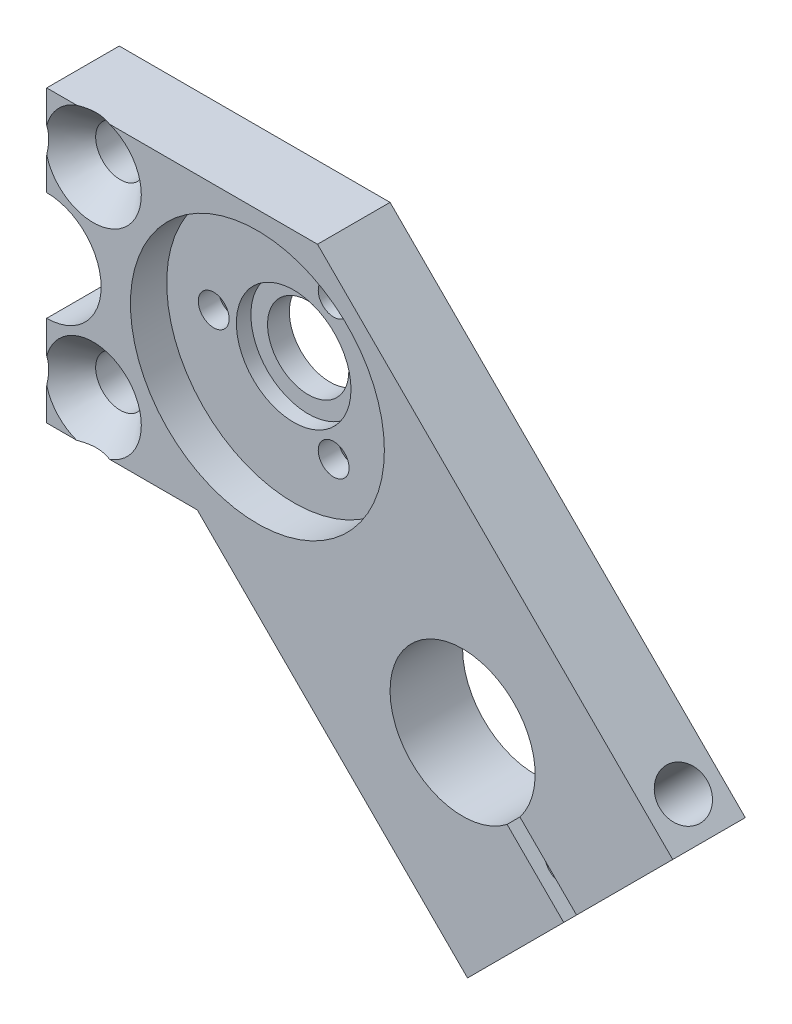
from build123d import *

# Parameters (mm, degrees)
SKETCH1_R                                         = 3.556
EXTRUDE1_DEPTH                                    = 6.35
CSK_FOR_8_FLAT_HEAD_MACHINE_SCREW1_D              = 4.3053
CSK_FOR_8_FLAT_HEAD_MACHINE_SCREW1_CSINK_D        = 8.4328
CSK_FOR_8_FLAT_HEAD_MACHINE_SCREW1_CSINK_ANGLE    = 82
SKETCH3_R                                         = 11.1125
CUT_EXTRUDE1_DEPTH                                = 3.175
SKETCH4_R                                         = 5.0165
CUT_EXTRUDE2_DEPTH                                = 1.27
CSK_FOR_M2_5_FLAT_HEAD_MACHINE_SCREW1_D           = 2.7
CSK_FOR_M2_5_FLAT_HEAD_MACHINE_SCREW1_CSINK_D     = 5.5
CSK_FOR_M2_5_FLAT_HEAD_MACHINE_SCREW1_CSINK_ANGLE = 90
CIRPATTERN1_COUNT                                 = 3
F_8_CLEARANCE_HOLE1_D                             = 4.3053
F_8_CLEARANCE_HOLE1_DEPTH                         = 12.7
F_8_CLEARANCE_HOLE1_TIP                           = 1.293442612
F_8_32_TAPPED_HOLE1_D                             = 3.4544
F_8_32_TAPPED_HOLE1_DEPTH                         = 14.986
F_8_32_TAPPED_HOLE1_CBORE_D                       = 4.1656
F_8_32_TAPPED_HOLE1_CBORE_DEPTH                   = 12.7
F_8_32_TAPPED_HOLE1_TIP                           = 1.037806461


with BuildPart() as part:
    # Sketch1 → Extrude1 (new body)
    with BuildSketch(Plane.XY):
        with BuildLine():
            Line((-18.4404, -4.7625), (-18.4404, -12.7))
            Line((-18.4404, -12.7), (-5.260512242, -12.7))
            Line((-5.260512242, -12.7), (18.391564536, -36.352076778))
            Line((18.391564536, -36.352076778), (26.810554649, -27.933086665))
            Line((26.810554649, -27.933086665), (21.854157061, -22.976689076))
            ThreePointArc((21.854157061, -22.976689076), (13.470384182, -13.470384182), (22.976689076, -21.854157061))
            Line((22.976689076, -21.854157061), (27.933086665, -26.810554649))
            Line((27.933086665, -26.810554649), (36.352076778, -18.391564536))
            Line((36.352076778, -18.391564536), (5.260512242, 12.7))
            Line((5.260512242, 12.7), (-18.4404, 12.7))
            Line((-18.4404, 12.7), (-18.4404, 4.7625))
            ThreePointArc((-18.4404, 4.7625), (-13.6779, 0), (-18.4404, -4.7625))
        make_face()
        Circle(SKETCH1_R, mode=Mode.SUBTRACT)
    extrude(amount=EXTRUDE1_DEPTH)

    # CSK for _8 Flat Head Machine Screw1 (through all)
    with Locations(Plane(origin=(-14.3764, 8.7376, 6.35), x_dir=(1, 0, 0), z_dir=(0, 0, 1))):
        with Locations((0, 0), (0, -17.4752)):
            CounterSinkHole(CSK_FOR_8_FLAT_HEAD_MACHINE_SCREW1_D / 2, CSK_FOR_8_FLAT_HEAD_MACHINE_SCREW1_CSINK_D / 2, counter_sink_angle=CSK_FOR_8_FLAT_HEAD_MACHINE_SCREW1_CSINK_ANGLE)

    # Sketch3 → Cut-Extrude1 (cut)
    with BuildSketch(Plane.XY.offset(6.35)):
        Circle(SKETCH3_R)
    extrude(amount=-CUT_EXTRUDE1_DEPTH, mode=Mode.SUBTRACT)

    # Sketch4 → Cut-Extrude2 (cut)
    with BuildSketch(Plane.XY.offset(3.175)):
        Circle(SKETCH4_R)
    extrude(amount=-CUT_EXTRUDE2_DEPTH, mode=Mode.SUBTRACT)

    # CSK for M2.5 Flat Head Machine Screw1 (through all)
    with Locations(Plane(origin=(-7.000398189, 0, 0), x_dir=(-1, 0, 0), z_dir=(0, 0, -1))):
        with Locations((0, 0)):
            csk_for_m2_5_flat_head_machine_screw1 = CounterSinkHole(CSK_FOR_M2_5_FLAT_HEAD_MACHINE_SCREW1_D / 2, CSK_FOR_M2_5_FLAT_HEAD_MACHINE_SCREW1_CSINK_D / 2, counter_sink_angle=CSK_FOR_M2_5_FLAT_HEAD_MACHINE_SCREW1_CSINK_ANGLE)

    # CirPattern1: CSK for M2.5 Flat Head Machine Screw1 ×3 about axis
    cirpattern1_axis = Axis((0, 0, 0), (0, 0, 1))
    for i in range(1, CIRPATTERN1_COUNT):
        add(csk_for_m2_5_flat_head_machine_screw1.rotate(cirpattern1_axis, i * 360 / CIRPATTERN1_COUNT), mode=Mode.SUBTRACT)

    # 8 Clearance Hole1
    with Locations(Plane(origin=(16.146500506, -34.107012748, 3.175), x_dir=(0.707106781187, -0.707106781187, 0), z_dir=(-0.707106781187, -0.707106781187, 0))):
        with Locations((0, 0)):
            Hole(F_8_CLEARANCE_HOLE1_D / 2, depth=F_8_CLEARANCE_HOLE1_DEPTH)
            with Locations((0, 0, -(F_8_CLEARANCE_HOLE1_DEPTH + F_8_CLEARANCE_HOLE1_TIP / 2))):  # 118° drill point
                Cone(0, F_8_CLEARANCE_HOLE1_D / 2, F_8_CLEARANCE_HOLE1_TIP, mode=Mode.SUBTRACT)

    # 8-32 Tapped Hole1
    with Locations(Plane(origin=(34.107012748, -16.146500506, 3.175), x_dir=(-0.707106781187, 0.707106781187, 0), z_dir=(0.707106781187, 0.707106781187, 0))):
        with Locations((0, 0)):
            CounterBoreHole(F_8_32_TAPPED_HOLE1_D / 2, F_8_32_TAPPED_HOLE1_CBORE_D / 2, F_8_32_TAPPED_HOLE1_CBORE_DEPTH, depth=F_8_32_TAPPED_HOLE1_DEPTH)
            with Locations((0, 0, -(F_8_32_TAPPED_HOLE1_DEPTH + F_8_32_TAPPED_HOLE1_TIP / 2))):  # 118° drill point
                Cone(0, F_8_32_TAPPED_HOLE1_D / 2, F_8_32_TAPPED_HOLE1_TIP, mode=Mode.SUBTRACT)


solid = part.part
